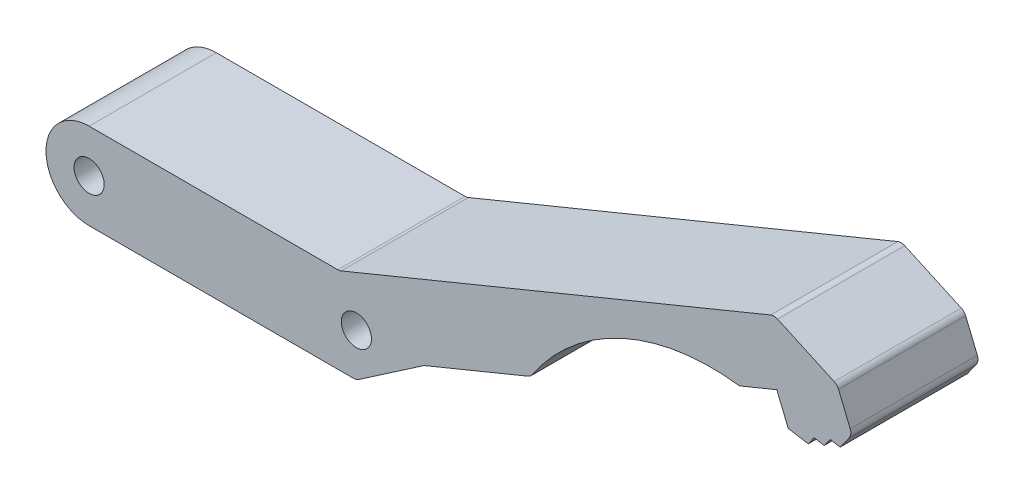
ISO-10303-21;
HEADER;
FILE_DESCRIPTION(('STEP AP214'),'2;1');
FILE_NAME('part.step','',(''),(''),'','','');
FILE_SCHEMA(('AUTOMOTIVE_DESIGN { 1 0 10303 214 1 1 1 1 }'));
ENDSEC;
DATA;
#1=APPLICATION_CONTEXT('core data for automotive mechanical design processes');
#2=APPLICATION_PROTOCOL_DEFINITION('international standard','automotive_design',2000,#1);
#3=PRODUCT_CONTEXT('',#1,'mechanical');
#4=PRODUCT('Part','Part','',(#3));
#5=PRODUCT_RELATED_PRODUCT_CATEGORY('part','',(#4));
#6=PRODUCT_DEFINITION_FORMATION('','',#4);
#7=PRODUCT_DEFINITION_CONTEXT('part definition',#1,'design');
#8=PRODUCT_DEFINITION('design','',#6,#7);
#9=PRODUCT_DEFINITION_SHAPE('','',#8);
#10=(LENGTH_UNIT() NAMED_UNIT(*) SI_UNIT(.MILLI.,.METRE.));
#11=(NAMED_UNIT(*) PLANE_ANGLE_UNIT() SI_UNIT($,.RADIAN.));
#12=(NAMED_UNIT(*) SI_UNIT($,.STERADIAN.) SOLID_ANGLE_UNIT());
#13=UNCERTAINTY_MEASURE_WITH_UNIT(LENGTH_MEASURE(1.E-05),#10,'distance_accuracy_value','');
#14=(GEOMETRIC_REPRESENTATION_CONTEXT(3) GLOBAL_UNCERTAINTY_ASSIGNED_CONTEXT((#13)) GLOBAL_UNIT_ASSIGNED_CONTEXT((#10,
#11,#12)) REPRESENTATION_CONTEXT('',''));
#15=CARTESIAN_POINT('',(0.,0.,0.));
#16=DIRECTION('',(0.,0.,1.));
#17=DIRECTION('',(1.,0.,0.));
#18=AXIS2_PLACEMENT_3D('',#15,#16,#17);
#19=CARTESIAN_POINT('',(4.18285581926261,-10.1735590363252,7.375));
#20=DIRECTION('',(0.380263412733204,-0.92487822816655,0.));
#21=DIRECTION('',(0.92487822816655,0.380263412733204,0.));
#22=AXIS2_PLACEMENT_3D('',#19,#20,#21);
#23=PLANE('',#22);
#24=DIRECTION('',(-0.92487822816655,-0.380263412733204,0.));
#25=VECTOR('',#24,1.);
#26=CARTESIAN_POINT('',(4.18285581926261,-10.1735590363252,-7.375));
#27=LINE('',#26,#25);
#28=CARTESIAN_POINT('',(41.9373455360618,5.34918835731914,-7.375));
#29=VERTEX_POINT('',#28);
#30=CARTESIAN_POINT('',(29.9516692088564,0.421281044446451,-7.375));
#31=VERTEX_POINT('',#30);
#32=EDGE_CURVE('E278',#29,#31,#27,.T.);
#33=ORIENTED_EDGE('',*,*,#32,.F.);
#34=DIRECTION('',(0.,0.,1.));
#35=VECTOR('',#34,1.);
#36=CARTESIAN_POINT('',(41.9373455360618,5.34918835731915,7.375));
#37=LINE('',#36,#35);
#38=CARTESIAN_POINT('',(41.9373455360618,5.34918835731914,7.375));
#39=VERTEX_POINT('',#38);
#40=EDGE_CURVE('E363',#29,#39,#37,.T.);
#41=ORIENTED_EDGE('',*,*,#40,.T.);
#42=DIRECTION('',(-0.92487822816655,-0.380263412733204,0.));
#43=VECTOR('',#42,1.);
#44=CARTESIAN_POINT('',(4.18285581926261,-10.1735590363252,7.375));
#45=LINE('',#44,#43);
#46=CARTESIAN_POINT('',(29.9516692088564,0.421281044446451,7.375));
#47=VERTEX_POINT('',#46);
#48=EDGE_CURVE('E215',#39,#47,#45,.T.);
#49=ORIENTED_EDGE('',*,*,#48,.T.);
#50=DIRECTION('',(0.,0.,-1.));
#51=VECTOR('',#50,1.);
#52=CARTESIAN_POINT('',(29.9516692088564,0.421281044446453,-7.375));
#53=LINE('',#52,#51);
#54=EDGE_CURVE('E360',#47,#31,#53,.T.);
#55=ORIENTED_EDGE('',*,*,#54,.T.);
#56=EDGE_LOOP('',(#33,#41,#49,#55));
#57=FACE_BOUND('',#56,.T.);
#58=ADVANCED_FACE('F41',(#57),#23,.T.);
#59=CARTESIAN_POINT('',(63.1527344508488,-8.10069108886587,7.375));
#60=DIRECTION('',(0.,0.,-1.));
#61=DIRECTION('',(-1.,0.,0.));
#62=AXIS2_PLACEMENT_3D('',#59,#60,#61);
#63=CYLINDRICAL_SURFACE('',#62,24.9423564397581);
#64=CARTESIAN_POINT('',(63.1527344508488,-8.10069108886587,7.375));
#65=DIRECTION('',(0.,0.,1.));
#66=DIRECTION('',(1.,0.,0.));
#67=AXIS2_PLACEMENT_3D('',#64,#65,#66);
#68=CIRCLE('',#67,24.9423564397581);
#69=CARTESIAN_POINT('',(42.3895297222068,5.71996280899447,7.375));
#70=VERTEX_POINT('',#69);
#71=CARTESIAN_POINT('',(66.4298223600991,16.6254456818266,7.375));
#72=VERTEX_POINT('',#71);
#73=EDGE_CURVE('E202',#70,#72,#68,.F.);
#74=ORIENTED_EDGE('',*,*,#73,.F.);
#75=DIRECTION('',(0.,0.,-1.));
#76=VECTOR('',#75,1.);
#77=CARTESIAN_POINT('',(42.3895297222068,5.71996280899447,7.375));
#78=LINE('',#77,#76);
#79=CARTESIAN_POINT('',(42.3895297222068,5.71996280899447,-7.375));
#80=VERTEX_POINT('',#79);
#81=EDGE_CURVE('E225',#70,#80,#78,.T.);
#82=ORIENTED_EDGE('',*,*,#81,.T.);
#83=CARTESIAN_POINT('',(63.1527344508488,-8.10069108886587,-7.375));
#84=DIRECTION('',(0.,0.,1.));
#85=DIRECTION('',(1.,0.,0.));
#86=AXIS2_PLACEMENT_3D('',#83,#84,#85);
#87=CIRCLE('',#86,24.9423564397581);
#88=CARTESIAN_POINT('',(66.4298223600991,16.6254456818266,-7.375));
#89=VERTEX_POINT('',#88);
#90=EDGE_CURVE('E221',#80,#89,#87,.F.);
#91=ORIENTED_EDGE('',*,*,#90,.T.);
#92=DIRECTION('',(0.,0.,-1.));
#93=VECTOR('',#92,1.);
#94=CARTESIAN_POINT('',(66.4298223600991,16.6254456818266,7.375));
#95=LINE('',#94,#93);
#96=EDGE_CURVE('E218',#72,#89,#95,.T.);
#97=ORIENTED_EDGE('',*,*,#96,.F.);
#98=EDGE_LOOP('',(#74,#82,#91,#97));
#99=FACE_BOUND('',#98,.T.);
#100=ADVANCED_FACE('F219',(#99),#63,.F.);
#101=CARTESIAN_POINT('',(3.75864457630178,-9.14179071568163,7.375));
#102=DIRECTION('',(0.380263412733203,-0.924878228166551,0.));
#103=DIRECTION('',(0.924878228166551,0.380263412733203,0.));
#104=AXIS2_PLACEMENT_3D('',#101,#102,#103);
#105=PLANE('',#104);
#106=DIRECTION('',(-0.924878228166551,-0.380263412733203,0.));
#107=VECTOR('',#106,1.);
#108=CARTESIAN_POINT('',(3.75864457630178,-9.14179071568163,-7.375));
#109=LINE('',#108,#107);
#110=CARTESIAN_POINT('',(70.7615639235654,18.4064399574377,-7.375));
#111=VERTEX_POINT('',#110);
#112=EDGE_CURVE('E282',#111,#89,#109,.T.);
#113=ORIENTED_EDGE('',*,*,#112,.F.);
#114=DIRECTION('',(0.,0.,-1.));
#115=VECTOR('',#114,1.);
#116=CARTESIAN_POINT('',(70.7615639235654,18.4064399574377,7.375));
#117=LINE('',#116,#115);
#118=CARTESIAN_POINT('',(70.7615639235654,18.4064399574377,7.375));
#119=VERTEX_POINT('',#118);
#120=EDGE_CURVE('E226',#119,#111,#117,.T.);
#121=ORIENTED_EDGE('',*,*,#120,.F.);
#122=DIRECTION('',(-0.924878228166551,-0.380263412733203,0.));
#123=VECTOR('',#122,1.);
#124=CARTESIAN_POINT('',(3.75864457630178,-9.14179071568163,7.375));
#125=LINE('',#124,#123);
#126=EDGE_CURVE('E208',#119,#72,#125,.T.);
#127=ORIENTED_EDGE('',*,*,#126,.T.);
#128=ORIENTED_EDGE('',*,*,#96,.T.);
#129=EDGE_LOOP('',(#113,#121,#127,#128));
#130=FACE_BOUND('',#129,.T.);
#131=ADVANCED_FACE('F228',(#130),#105,.T.);
#132=CARTESIAN_POINT('',(67.0029193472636,27.5482306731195,7.375));
#133=DIRECTION('',(-0.92487822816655,-0.380263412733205,0.));
#134=DIRECTION('',(0.380263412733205,-0.92487822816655,0.));
#135=AXIS2_PLACEMENT_3D('',#132,#133,#134);
#136=PLANE('',#135);
#137=DIRECTION('',(-0.380263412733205,0.92487822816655,0.));
#138=VECTOR('',#137,1.);
#139=CARTESIAN_POINT('',(67.0029193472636,27.5482306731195,-7.375));
#140=LINE('',#139,#138);
#141=CARTESIAN_POINT('',(72.0850784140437,15.1873825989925,-7.375));
#142=VERTEX_POINT('',#141);
#143=EDGE_CURVE('E284',#142,#111,#140,.T.);
#144=ORIENTED_EDGE('',*,*,#143,.F.);
#145=DIRECTION('',(0.,0.,-1.));
#146=VECTOR('',#145,1.);
#147=CARTESIAN_POINT('',(72.0850784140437,15.1873825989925,7.375));
#148=LINE('',#147,#146);
#149=CARTESIAN_POINT('',(72.0850784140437,15.1873825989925,7.375));
#150=VERTEX_POINT('',#149);
#151=EDGE_CURVE('E346',#150,#142,#148,.T.);
#152=ORIENTED_EDGE('',*,*,#151,.F.);
#153=DIRECTION('',(-0.380263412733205,0.92487822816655,0.));
#154=VECTOR('',#153,1.);
#155=CARTESIAN_POINT('',(67.0029193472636,27.5482306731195,7.375));
#156=LINE('',#155,#154);
#157=EDGE_CURVE('E229',#150,#119,#156,.T.);
#158=ORIENTED_EDGE('',*,*,#157,.T.);
#159=ORIENTED_EDGE('',*,*,#120,.T.);
#160=EDGE_LOOP('',(#144,#152,#158,#159));
#161=FACE_BOUND('',#160,.T.);
#162=ADVANCED_FACE('F532',(#161),#136,.T.);
#163=CARTESIAN_POINT('',(4.53896645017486,26.6791224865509,7.375));
#164=DIRECTION('',(0.167721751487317,0.98583437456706,0.));
#165=DIRECTION('',(-0.98583437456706,0.167721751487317,0.));
#166=AXIS2_PLACEMENT_3D('',#163,#164,#165);
#167=PLANE('',#166);
#168=DIRECTION('',(0.98583437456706,-0.167721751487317,0.));
#169=VECTOR('',#168,1.);
#170=CARTESIAN_POINT('',(4.53896645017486,26.6791224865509,-7.375));
#171=LINE('',#170,#169);
#172=CARTESIAN_POINT('',(74.4101641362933,14.7918116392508,-7.375));
#173=VERTEX_POINT('',#172);
#174=EDGE_CURVE('E287',#142,#173,#171,.T.);
#175=ORIENTED_EDGE('',*,*,#174,.T.);
#176=DIRECTION('',(0.,0.,-1.));
#177=VECTOR('',#176,1.);
#178=CARTESIAN_POINT('',(74.4101641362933,14.7918116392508,7.375));
#179=LINE('',#178,#177);
#180=CARTESIAN_POINT('',(74.4101641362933,14.7918116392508,7.375));
#181=VERTEX_POINT('',#180);
#182=EDGE_CURVE('E343',#181,#173,#179,.T.);
#183=ORIENTED_EDGE('',*,*,#182,.F.);
#184=DIRECTION('',(0.98583437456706,-0.167721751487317,0.));
#185=VECTOR('',#184,1.);
#186=CARTESIAN_POINT('',(4.53896645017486,26.6791224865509,7.375));
#187=LINE('',#186,#185);
#188=EDGE_CURVE('E231',#150,#181,#187,.T.);
#189=ORIENTED_EDGE('',*,*,#188,.F.);
#190=ORIENTED_EDGE('',*,*,#151,.T.);
#191=EDGE_LOOP('',(#175,#183,#189,#190));
#192=FACE_BOUND('',#191,.T.);
#193=ADVANCED_FACE('F534',(#192),#167,.F.);
#194=CARTESIAN_POINT('',(42.1351042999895,-30.2154280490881,7.375));
#195=DIRECTION('',(-0.812647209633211,0.582755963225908,0.));
#196=DIRECTION('',(-0.582755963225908,-0.812647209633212,0.));
#197=AXIS2_PLACEMENT_3D('',#194,#195,#196);
#198=PLANE('',#197);
#199=DIRECTION('',(0.582755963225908,0.812647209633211,0.));
#200=VECTOR('',#199,1.);
#201=CARTESIAN_POINT('',(42.1351042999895,-30.2154280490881,-7.375));
#202=LINE('',#201,#200);
#203=CARTESIAN_POINT('',(75.0973777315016,15.750123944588,-7.375));
#204=VERTEX_POINT('',#203);
#205=EDGE_CURVE('E290',#173,#204,#202,.T.);
#206=ORIENTED_EDGE('',*,*,#205,.T.);
#207=DIRECTION('',(0.,0.,-1.));
#208=VECTOR('',#207,1.);
#209=CARTESIAN_POINT('',(75.0973777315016,15.750123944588,7.375));
#210=LINE('',#209,#208);
#211=CARTESIAN_POINT('',(75.0973777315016,15.750123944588,7.375));
#212=VERTEX_POINT('',#211);
#213=EDGE_CURVE('E340',#212,#204,#210,.T.);
#214=ORIENTED_EDGE('',*,*,#213,.F.);
#215=DIRECTION('',(0.582755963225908,0.812647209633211,0.));
#216=VECTOR('',#215,1.);
#217=CARTESIAN_POINT('',(42.1351042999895,-30.2154280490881,7.375));
#218=LINE('',#217,#216);
#219=EDGE_CURVE('E237',#181,#212,#218,.T.);
#220=ORIENTED_EDGE('',*,*,#219,.F.);
#221=ORIENTED_EDGE('',*,*,#182,.T.);
#222=EDGE_LOOP('',(#206,#214,#220,#221));
#223=FACE_BOUND('',#222,.T.);
#224=ADVANCED_FACE('F526',(#223),#198,.F.);
#225=CARTESIAN_POINT('',(4.71675115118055,27.7241048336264,7.375));
#226=DIRECTION('',(0.167721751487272,0.985834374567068,0.));
#227=DIRECTION('',(-0.985834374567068,0.167721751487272,0.));
#228=AXIS2_PLACEMENT_3D('',#225,#226,#227);
#229=PLANE('',#228);
#230=DIRECTION('',(0.985834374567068,-0.167721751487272,0.));
#231=VECTOR('',#230,1.);
#232=CARTESIAN_POINT('',(4.71675115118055,27.7241048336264,-7.375));
#233=LINE('',#232,#231);
#234=CARTESIAN_POINT('',(76.2599205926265,15.5523384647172,-7.375));
#235=VERTEX_POINT('',#234);
#236=EDGE_CURVE('E293',#204,#235,#233,.T.);
#237=ORIENTED_EDGE('',*,*,#236,.T.);
#238=DIRECTION('',(0.,0.,-1.));
#239=VECTOR('',#238,1.);
#240=CARTESIAN_POINT('',(76.2599205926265,15.5523384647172,7.375));
#241=LINE('',#240,#239);
#242=CARTESIAN_POINT('',(76.2599205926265,15.5523384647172,7.375));
#243=VERTEX_POINT('',#242);
#244=EDGE_CURVE('E337',#243,#235,#241,.T.);
#245=ORIENTED_EDGE('',*,*,#244,.F.);
#246=DIRECTION('',(0.985834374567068,-0.167721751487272,0.));
#247=VECTOR('',#246,1.);
#248=CARTESIAN_POINT('',(4.71675115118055,27.7241048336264,7.375));
#249=LINE('',#248,#247);
#250=EDGE_CURVE('E240',#212,#243,#249,.T.);
#251=ORIENTED_EDGE('',*,*,#250,.F.);
#252=ORIENTED_EDGE('',*,*,#213,.T.);
#253=EDGE_LOOP('',(#237,#245,#251,#252));
#254=FACE_BOUND('',#253,.T.);
#255=ADVANCED_FACE('F523',(#254),#229,.F.);
#256=CARTESIAN_POINT('',(42.9965086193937,-30.8331481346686,7.375));
#257=DIRECTION('',(-0.812647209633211,0.582755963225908,0.));
#258=DIRECTION('',(-0.582755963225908,-0.812647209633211,0.));
#259=AXIS2_PLACEMENT_3D('',#256,#257,#258);
#260=PLANE('',#259);
#261=DIRECTION('',(0.582755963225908,0.812647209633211,0.));
#262=VECTOR('',#261,1.);
#263=CARTESIAN_POINT('',(42.9965086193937,-30.8331481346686,-7.375));
#264=LINE('',#263,#262);
#265=CARTESIAN_POINT('',(76.9471341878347,16.5106507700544,-7.375));
#266=VERTEX_POINT('',#265);
#267=EDGE_CURVE('E296',#235,#266,#264,.T.);
#268=ORIENTED_EDGE('',*,*,#267,.T.);
#269=DIRECTION('',(0.,0.,-1.));
#270=VECTOR('',#269,1.);
#271=CARTESIAN_POINT('',(76.9471341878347,16.5106507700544,7.375));
#272=LINE('',#271,#270);
#273=CARTESIAN_POINT('',(76.9471341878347,16.5106507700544,7.375));
#274=VERTEX_POINT('',#273);
#275=EDGE_CURVE('E334',#274,#266,#272,.T.);
#276=ORIENTED_EDGE('',*,*,#275,.F.);
#277=DIRECTION('',(0.582755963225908,0.812647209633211,0.));
#278=VECTOR('',#277,1.);
#279=CARTESIAN_POINT('',(42.9965086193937,-30.8331481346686,7.375));
#280=LINE('',#279,#278);
#281=EDGE_CURVE('E243',#243,#274,#280,.T.);
#282=ORIENTED_EDGE('',*,*,#281,.F.);
#283=ORIENTED_EDGE('',*,*,#244,.T.);
#284=EDGE_LOOP('',(#268,#276,#282,#283));
#285=FACE_BOUND('',#284,.T.);
#286=ADVANCED_FACE('F521',(#285),#260,.F.);
#287=CARTESIAN_POINT('',(4.89453585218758,28.7690871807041,7.375));
#288=DIRECTION('',(0.167721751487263,0.985834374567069,0.));
#289=DIRECTION('',(-0.985834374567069,0.167721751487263,0.));
#290=AXIS2_PLACEMENT_3D('',#287,#288,#289);
#291=PLANE('',#290);
#292=DIRECTION('',(0.985834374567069,-0.167721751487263,0.));
#293=VECTOR('',#292,1.);
#294=CARTESIAN_POINT('',(4.89453585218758,28.7690871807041,-7.375));
#295=LINE('',#294,#293);
#296=CARTESIAN_POINT('',(78.1096770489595,16.3128652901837,-7.375));
#297=VERTEX_POINT('',#296);
#298=EDGE_CURVE('E299',#266,#297,#295,.T.);
#299=ORIENTED_EDGE('',*,*,#298,.T.);
#300=DIRECTION('',(0.,0.,-1.));
#301=VECTOR('',#300,1.);
#302=CARTESIAN_POINT('',(78.1096770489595,16.3128652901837,7.375));
#303=LINE('',#302,#301);
#304=CARTESIAN_POINT('',(78.1096770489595,16.3128652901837,7.375));
#305=VERTEX_POINT('',#304);
#306=EDGE_CURVE('E331',#305,#297,#303,.T.);
#307=ORIENTED_EDGE('',*,*,#306,.F.);
#308=DIRECTION('',(0.985834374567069,-0.167721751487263,0.));
#309=VECTOR('',#308,1.);
#310=CARTESIAN_POINT('',(4.89453585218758,28.7690871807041,7.375));
#311=LINE('',#310,#309);
#312=EDGE_CURVE('E246',#274,#305,#311,.T.);
#313=ORIENTED_EDGE('',*,*,#312,.F.);
#314=ORIENTED_EDGE('',*,*,#275,.T.);
#315=EDGE_LOOP('',(#299,#307,#313,#314));
#316=FACE_BOUND('',#315,.T.);
#317=ADVANCED_FACE('F517',(#316),#291,.F.);
#318=CARTESIAN_POINT('',(43.8579129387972,-31.4508682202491,7.375));
#319=DIRECTION('',(-0.812647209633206,0.582755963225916,0.));
#320=DIRECTION('',(-0.582755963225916,-0.812647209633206,0.));
#321=AXIS2_PLACEMENT_3D('',#318,#319,#320);
#322=PLANE('',#321);
#323=DIRECTION('',(0.582755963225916,0.812647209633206,0.));
#324=VECTOR('',#323,1.);
#325=CARTESIAN_POINT('',(43.8579129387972,-31.4508682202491,-7.375));
#326=LINE('',#325,#324);
#327=CARTESIAN_POINT('',(79.161113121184,17.7790821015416,-7.375));
#328=VERTEX_POINT('',#327);
#329=EDGE_CURVE('E302',#297,#328,#326,.T.);
#330=ORIENTED_EDGE('',*,*,#329,.T.);
#331=DIRECTION('',(0.,0.,-1.));
#332=VECTOR('',#331,1.);
#333=CARTESIAN_POINT('',(79.161113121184,17.7790821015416,7.375));
#334=LINE('',#333,#332);
#335=CARTESIAN_POINT('',(79.161113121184,17.7790821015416,7.375));
#336=VERTEX_POINT('',#335);
#337=EDGE_CURVE('E386',#328,#336,#334,.F.);
#338=ORIENTED_EDGE('',*,*,#337,.T.);
#339=DIRECTION('',(0.582755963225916,0.812647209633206,0.));
#340=VECTOR('',#339,1.);
#341=CARTESIAN_POINT('',(43.8579129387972,-31.4508682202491,7.375));
#342=LINE('',#341,#340);
#343=EDGE_CURVE('E249',#305,#336,#342,.T.);
#344=ORIENTED_EDGE('',*,*,#343,.F.);
#345=ORIENTED_EDGE('',*,*,#306,.T.);
#346=EDGE_LOOP('',(#330,#338,#344,#345));
#347=FACE_BOUND('',#346,.T.);
#348=ADVANCED_FACE('F514',(#347),#322,.F.);
#349=CARTESIAN_POINT('',(74.4019451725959,30.5903379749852,7.375));
#350=DIRECTION('',(0.924878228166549,0.380263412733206,0.));
#351=DIRECTION('',(-0.380263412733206,0.924878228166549,0.));
#352=AXIS2_PLACEMENT_3D('',#349,#350,#351);
#353=PLANE('',#352);
#354=DIRECTION('',(0.380263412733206,-0.924878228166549,0.));
#355=VECTOR('',#354,1.);
#356=CARTESIAN_POINT('',(74.4019451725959,30.5903379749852,7.375));
#357=LINE('',#356,#355);
#358=CARTESIAN_POINT('',(77.9233252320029,22.0256229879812,7.375));
#359=VERTEX_POINT('',#358);
#360=CARTESIAN_POINT('',(79.2733441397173,18.7421014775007,7.375));
#361=VERTEX_POINT('',#360);
#362=EDGE_CURVE('E252',#359,#361,#357,.T.);
#363=ORIENTED_EDGE('',*,*,#362,.T.);
#364=DIRECTION('',(0.,0.,-1.));
#365=VECTOR('',#364,1.);
#366=CARTESIAN_POINT('',(79.2733441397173,18.7421014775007,-7.375));
#367=LINE('',#366,#365);
#368=CARTESIAN_POINT('',(79.2733441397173,18.7421014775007,-7.375));
#369=VERTEX_POINT('',#368);
#370=EDGE_CURVE('E383',#361,#369,#367,.T.);
#371=ORIENTED_EDGE('',*,*,#370,.T.);
#372=DIRECTION('',(0.380263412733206,-0.924878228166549,0.));
#373=VECTOR('',#372,1.);
#374=CARTESIAN_POINT('',(74.4019451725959,30.5903379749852,-7.375));
#375=LINE('',#374,#373);
#376=CARTESIAN_POINT('',(77.9233252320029,22.0256229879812,-7.375));
#377=VERTEX_POINT('',#376);
#378=EDGE_CURVE('E305',#377,#369,#375,.T.);
#379=ORIENTED_EDGE('',*,*,#378,.F.);
#380=DIRECTION('',(0.,0.,-1.));
#381=VECTOR('',#380,1.);
#382=CARTESIAN_POINT('',(77.9233252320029,22.0256229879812,7.375));
#383=LINE('',#382,#381);
#384=EDGE_CURVE('E381',#377,#359,#383,.F.);
#385=ORIENTED_EDGE('',*,*,#384,.T.);
#386=EDGE_LOOP('',(#363,#371,#379,#385));
#387=FACE_BOUND('',#386,.T.);
#388=ADVANCED_FACE('F508',(#387),#353,.T.);
#389=CARTESIAN_POINT('',(21.8103769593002,47.8823439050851,7.375));
#390=DIRECTION('',(0.414522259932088,0.910039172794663,0.));
#391=DIRECTION('',(-0.910039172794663,0.414522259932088,0.));
#392=AXIS2_PLACEMENT_3D('',#389,#390,#391);
#393=PLANE('',#392);
#394=DIRECTION('',(0.910039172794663,-0.414522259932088,0.));
#395=VECTOR('',#394,1.);
#396=CARTESIAN_POINT('',(21.8103769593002,47.8823439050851,7.375));
#397=LINE('',#396,#395);
#398=CARTESIAN_POINT('',(70.8500425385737,25.54480766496,7.375));
#399=VERTEX_POINT('',#398);
#400=CARTESIAN_POINT('',(77.4129692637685,22.5553987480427,7.375));
#401=VERTEX_POINT('',#400);
#402=EDGE_CURVE('E255',#399,#401,#397,.T.);
#403=ORIENTED_EDGE('',*,*,#402,.T.);
#404=DIRECTION('',(0.,0.,-1.));
#405=VECTOR('',#404,1.);
#406=CARTESIAN_POINT('',(77.4129692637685,22.5553987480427,7.375));
#407=LINE('',#406,#405);
#408=CARTESIAN_POINT('',(77.4129692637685,22.5553987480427,-7.375));
#409=VERTEX_POINT('',#408);
#410=EDGE_CURVE('E390',#401,#409,#407,.T.);
#411=ORIENTED_EDGE('',*,*,#410,.T.);
#412=DIRECTION('',(0.910039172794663,-0.414522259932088,0.));
#413=VECTOR('',#412,1.);
#414=CARTESIAN_POINT('',(21.8103769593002,47.8823439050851,-7.375));
#415=LINE('',#414,#413);
#416=CARTESIAN_POINT('',(70.8500425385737,25.54480766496,-7.375));
#417=VERTEX_POINT('',#416);
#418=EDGE_CURVE('E308',#417,#409,#415,.T.);
#419=ORIENTED_EDGE('',*,*,#418,.F.);
#420=DIRECTION('',(0.,0.,-1.));
#421=VECTOR('',#420,1.);
#422=CARTESIAN_POINT('',(70.8500425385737,25.54480766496,7.375));
#423=LINE('',#422,#421);
#424=EDGE_CURVE('E388',#417,#399,#423,.F.);
#425=ORIENTED_EDGE('',*,*,#424,.T.);
#426=EDGE_LOOP('',(#403,#411,#419,#425));
#427=FACE_BOUND('',#426,.T.);
#428=ADVANCED_FACE('F501',(#427),#393,.T.);
#429=CARTESIAN_POINT('',(1.14074851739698,-2.7745332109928,7.375));
#430=DIRECTION('',(-0.380263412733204,0.92487822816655,0.));
#431=DIRECTION('',(-0.92487822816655,-0.380263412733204,0.));
#432=AXIS2_PLACEMENT_3D('',#429,#430,#431);
#433=PLANE('',#432);
#434=DIRECTION('',(0.92487822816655,0.380263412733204,0.));
#435=VECTOR('',#434,1.);
#436=CARTESIAN_POINT('',(1.14074851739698,-2.7745332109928,-7.375));
#437=LINE('',#436,#435);
#438=CARTESIAN_POINT('',(20.2327114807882,5.07512177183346,-7.375));
#439=VERTEX_POINT('',#438);
#440=CARTESIAN_POINT('',(70.0552568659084,25.5596467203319,-7.375));
#441=VERTEX_POINT('',#440);
#442=EDGE_CURVE('E311',#439,#441,#437,.T.);
#443=ORIENTED_EDGE('',*,*,#442,.F.);
#444=DIRECTION('',(0.,0.,-1.));
#445=VECTOR('',#444,1.);
#446=CARTESIAN_POINT('',(20.2327114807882,5.07512177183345,7.375));
#447=LINE('',#446,#445);
#448=CARTESIAN_POINT('',(20.2327114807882,5.07512177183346,7.375));
#449=VERTEX_POINT('',#448);
#450=EDGE_CURVE('E379',#439,#449,#447,.F.);
#451=ORIENTED_EDGE('',*,*,#450,.T.);
#452=DIRECTION('',(0.92487822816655,0.380263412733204,0.));
#453=VECTOR('',#452,1.);
#454=CARTESIAN_POINT('',(1.14074851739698,-2.7745332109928,7.375));
#455=LINE('',#454,#453);
#456=CARTESIAN_POINT('',(70.0552568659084,25.5596467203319,7.375));
#457=VERTEX_POINT('',#456);
#458=EDGE_CURVE('E258',#449,#457,#455,.T.);
#459=ORIENTED_EDGE('',*,*,#458,.T.);
#460=DIRECTION('',(0.,0.,-1.));
#461=VECTOR('',#460,1.);
#462=CARTESIAN_POINT('',(70.0552568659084,25.5596467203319,7.375));
#463=LINE('',#462,#461);
#464=EDGE_CURVE('E376',#457,#441,#463,.T.);
#465=ORIENTED_EDGE('',*,*,#464,.T.);
#466=EDGE_LOOP('',(#443,#451,#459,#465));
#467=FACE_BOUND('',#466,.T.);
#468=ADVANCED_FACE('F494',(#467),#433,.T.);
#469=CARTESIAN_POINT('',(0.,5.,7.375));
#470=DIRECTION('',(0.,1.,0.));
#471=DIRECTION('',(-1.,0.,0.));
#472=AXIS2_PLACEMENT_3D('',#469,#470,#471);
#473=PLANE('',#472);
#474=DIRECTION('',(1.,0.,0.));
#475=VECTOR('',#474,1.);
#476=CARTESIAN_POINT('',(0.,5.,7.375));
#477=LINE('',#476,#475);
#478=CARTESIAN_POINT('',(-9.,5.,7.375));
#479=VERTEX_POINT('',#478);
#480=CARTESIAN_POINT('',(19.852448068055,5.,7.375));
#481=VERTEX_POINT('',#480);
#482=EDGE_CURVE('E261',#479,#481,#477,.T.);
#483=ORIENTED_EDGE('',*,*,#482,.T.);
#484=DIRECTION('',(0.,0.,-1.));
#485=VECTOR('',#484,1.);
#486=CARTESIAN_POINT('',(19.852448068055,5.,-7.375));
#487=LINE('',#486,#485);
#488=CARTESIAN_POINT('',(19.852448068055,5.,-7.375));
#489=VERTEX_POINT('',#488);
#490=EDGE_CURVE('E373',#481,#489,#487,.T.);
#491=ORIENTED_EDGE('',*,*,#490,.T.);
#492=DIRECTION('',(1.,0.,0.));
#493=VECTOR('',#492,1.);
#494=CARTESIAN_POINT('',(0.,5.,-7.375));
#495=LINE('',#494,#493);
#496=CARTESIAN_POINT('',(-9.,5.,-7.375));
#497=VERTEX_POINT('',#496);
#498=EDGE_CURVE('E314',#497,#489,#495,.T.);
#499=ORIENTED_EDGE('',*,*,#498,.F.);
#500=DIRECTION('',(0.,0.,-1.));
#501=VECTOR('',#500,1.);
#502=CARTESIAN_POINT('',(-9.,5.,7.375));
#503=LINE('',#502,#501);
#504=EDGE_CURVE('E329',#479,#497,#503,.T.);
#505=ORIENTED_EDGE('',*,*,#504,.F.);
#506=EDGE_LOOP('',(#483,#491,#499,#505));
#507=FACE_BOUND('',#506,.T.);
#508=ADVANCED_FACE('F487',(#507),#473,.T.);
#509=CARTESIAN_POINT('',(-9.,0.,7.375));
#510=DIRECTION('',(0.,0.,-1.));
#511=DIRECTION('',(-1.,0.,0.));
#512=AXIS2_PLACEMENT_3D('',#509,#510,#511);
#513=CYLINDRICAL_SURFACE('',#512,5.);
#514=CARTESIAN_POINT('',(-9.,0.,-7.375));
#515=DIRECTION('',(0.,0.,1.));
#516=DIRECTION('',(1.,0.,0.));
#517=AXIS2_PLACEMENT_3D('',#514,#515,#516);
#518=CIRCLE('',#517,5.);
#519=CARTESIAN_POINT('',(-9.,-5.,-7.375));
#520=VERTEX_POINT('',#519);
#521=EDGE_CURVE('E317',#497,#520,#518,.T.);
#522=ORIENTED_EDGE('',*,*,#521,.T.);
#523=DIRECTION('',(0.,0.,-1.));
#524=VECTOR('',#523,1.);
#525=CARTESIAN_POINT('',(-9.,-5.,7.375));
#526=LINE('',#525,#524);
#527=CARTESIAN_POINT('',(-9.,-5.,7.375));
#528=VERTEX_POINT('',#527);
#529=EDGE_CURVE('E271',#528,#520,#526,.T.);
#530=ORIENTED_EDGE('',*,*,#529,.F.);
#531=CARTESIAN_POINT('',(-9.,0.,7.375));
#532=DIRECTION('',(0.,0.,1.));
#533=DIRECTION('',(1.,0.,0.));
#534=AXIS2_PLACEMENT_3D('',#531,#532,#533);
#535=CIRCLE('',#534,5.);
#536=EDGE_CURVE('E264',#479,#528,#535,.T.);
#537=ORIENTED_EDGE('',*,*,#536,.F.);
#538=ORIENTED_EDGE('',*,*,#504,.T.);
#539=EDGE_LOOP('',(#522,#530,#537,#538));
#540=FACE_BOUND('',#539,.T.);
#541=ADVANCED_FACE('F484',(#540),#513,.T.);
#542=CARTESIAN_POINT('',(0.,-5.,7.375));
#543=DIRECTION('',(0.,1.,0.));
#544=DIRECTION('',(-1.,0.,0.));
#545=AXIS2_PLACEMENT_3D('',#542,#543,#544);
#546=PLANE('',#545);
#547=DIRECTION('',(1.,0.,0.));
#548=VECTOR('',#547,1.);
#549=CARTESIAN_POINT('',(0.,-5.,-7.375));
#550=LINE('',#549,#548);
#551=CARTESIAN_POINT('',(21.6902867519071,-5.,-7.375));
#552=VERTEX_POINT('',#551);
#553=EDGE_CURVE('E320',#520,#552,#550,.T.);
#554=ORIENTED_EDGE('',*,*,#553,.T.);
#555=DIRECTION('',(0.,0.,-1.));
#556=VECTOR('',#555,1.);
#557=CARTESIAN_POINT('',(21.6902867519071,-5.,7.375));
#558=LINE('',#557,#556);
#559=CARTESIAN_POINT('',(21.6902867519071,-5.,7.375));
#560=VERTEX_POINT('',#559);
#561=EDGE_CURVE('E397',#552,#560,#558,.F.);
#562=ORIENTED_EDGE('',*,*,#561,.T.);
#563=DIRECTION('',(1.,0.,0.));
#564=VECTOR('',#563,1.);
#565=CARTESIAN_POINT('',(0.,-5.,7.375));
#566=LINE('',#565,#564);
#567=EDGE_CURVE('E267',#528,#560,#566,.T.);
#568=ORIENTED_EDGE('',*,*,#567,.F.);
#569=ORIENTED_EDGE('',*,*,#529,.T.);
#570=EDGE_LOOP('',(#554,#562,#568,#569));
#571=FACE_BOUND('',#570,.T.);
#572=ADVANCED_FACE('F432',(#571),#546,.F.);
#573=CARTESIAN_POINT('',(22.,0.,7.375));
#574=DIRECTION('',(0.,0.,-1.));
#575=DIRECTION('',(-1.,0.,0.));
#576=AXIS2_PLACEMENT_3D('',#573,#574,#575);
#577=CYLINDRICAL_SURFACE('',#576,1.75);
#578=CARTESIAN_POINT('',(22.,0.,7.375));
#579=DIRECTION('',(0.,0.,1.));
#580=DIRECTION('',(1.,0.,0.));
#581=AXIS2_PLACEMENT_3D('',#578,#579,#580);
#582=CIRCLE('',#581,1.75);
#583=CARTESIAN_POINT('',(23.75,0.,7.375));
#584=VERTEX_POINT('',#583);
#585=EDGE_CURVE('E414',#584,#584,#582,.T.);
#586=ORIENTED_EDGE('',*,*,#585,.T.);
#587=EDGE_LOOP('',(#586));
#588=FACE_BOUND('',#587,.T.);
#589=CARTESIAN_POINT('',(22.,0.,-7.375));
#590=DIRECTION('',(0.,0.,1.));
#591=DIRECTION('',(1.,0.,0.));
#592=AXIS2_PLACEMENT_3D('',#589,#590,#591);
#593=CIRCLE('',#592,1.75);
#594=CARTESIAN_POINT('',(23.75,0.,-7.375));
#595=VERTEX_POINT('',#594);
#596=EDGE_CURVE('E275',#595,#595,#593,.T.);
#597=ORIENTED_EDGE('',*,*,#596,.F.);
#598=EDGE_LOOP('',(#597));
#599=FACE_BOUND('',#598,.T.);
#600=ADVANCED_FACE('F429',(#588,#599),#577,.F.);
#601=CARTESIAN_POINT('',(-9.,0.,7.375));
#602=DIRECTION('',(0.,0.,-1.));
#603=DIRECTION('',(-1.,0.,0.));
#604=AXIS2_PLACEMENT_3D('',#601,#602,#603);
#605=CYLINDRICAL_SURFACE('',#604,1.75);
#606=CARTESIAN_POINT('',(-9.,0.,7.375));
#607=DIRECTION('',(0.,0.,1.));
#608=DIRECTION('',(1.,0.,0.));
#609=AXIS2_PLACEMENT_3D('',#606,#607,#608);
#610=CIRCLE('',#609,1.75);
#611=CARTESIAN_POINT('',(-7.25,0.,7.375));
#612=VERTEX_POINT('',#611);
#613=EDGE_CURVE('E326',#612,#612,#610,.T.);
#614=ORIENTED_EDGE('',*,*,#613,.T.);
#615=EDGE_LOOP('',(#614));
#616=FACE_BOUND('',#615,.T.);
#617=CARTESIAN_POINT('',(-9.,0.,-7.375));
#618=DIRECTION('',(0.,0.,1.));
#619=DIRECTION('',(1.,0.,0.));
#620=AXIS2_PLACEMENT_3D('',#617,#618,#619);
#621=CIRCLE('',#620,1.75);
#622=CARTESIAN_POINT('',(-7.25,0.,-7.375));
#623=VERTEX_POINT('',#622);
#624=EDGE_CURVE('E272',#623,#623,#621,.T.);
#625=ORIENTED_EDGE('',*,*,#624,.F.);
#626=EDGE_LOOP('',(#625));
#627=FACE_BOUND('',#626,.T.);
#628=ADVANCED_FACE('F421',(#616,#627),#605,.F.);
#629=CARTESIAN_POINT('',(9.35951951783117,-13.6605924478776,7.375));
#630=DIRECTION('',(0.565210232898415,-0.824946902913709,0.));
#631=DIRECTION('',(0.824946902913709,0.565210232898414,0.));
#632=AXIS2_PLACEMENT_3D('',#629,#630,#631);
#633=PLANE('',#632);
#634=DIRECTION('',(-0.824946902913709,-0.565210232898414,0.));
#635=VECTOR('',#634,1.);
#636=CARTESIAN_POINT('',(9.35951951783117,-13.6605924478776,-7.375));
#637=LINE('',#636,#635);
#638=CARTESIAN_POINT('',(29.7667223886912,0.321349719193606,-7.375));
#639=VERTEX_POINT('',#638);
#640=CARTESIAN_POINT('',(22.2554969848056,-4.82494690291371,-7.375));
#641=VERTEX_POINT('',#640);
#642=EDGE_CURVE('E323',#639,#641,#637,.T.);
#643=ORIENTED_EDGE('',*,*,#642,.F.);
#644=DIRECTION('',(0.,0.,-1.));
#645=VECTOR('',#644,1.);
#646=CARTESIAN_POINT('',(29.7667223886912,0.321349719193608,7.375));
#647=LINE('',#646,#645);
#648=CARTESIAN_POINT('',(29.7667223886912,0.321349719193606,7.375));
#649=VERTEX_POINT('',#648);
#650=EDGE_CURVE('E63',#639,#649,#647,.F.);
#651=ORIENTED_EDGE('',*,*,#650,.T.);
#652=DIRECTION('',(-0.824946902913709,-0.565210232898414,0.));
#653=VECTOR('',#652,1.);
#654=CARTESIAN_POINT('',(9.35951951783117,-13.6605924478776,7.375));
#655=LINE('',#654,#653);
#656=CARTESIAN_POINT('',(22.2554969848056,-4.82494690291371,7.375));
#657=VERTEX_POINT('',#656);
#658=EDGE_CURVE('E269',#649,#657,#655,.T.);
#659=ORIENTED_EDGE('',*,*,#658,.T.);
#660=DIRECTION('',(0.,0.,-1.));
#661=VECTOR('',#660,1.);
#662=CARTESIAN_POINT('',(22.2554969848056,-4.82494690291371,-7.375));
#663=LINE('',#662,#661);
#664=EDGE_CURVE('E393',#657,#641,#663,.T.);
#665=ORIENTED_EDGE('',*,*,#664,.T.);
#666=EDGE_LOOP('',(#643,#651,#659,#665));
#667=FACE_BOUND('',#666,.T.);
#668=ADVANCED_FACE('F407',(#667),#633,.T.);
#669=CARTESIAN_POINT('',(0.,0.,7.375));
#670=DIRECTION('',(0.,0.,1.));
#671=DIRECTION('',(1.,0.,0.));
#672=AXIS2_PLACEMENT_3D('',#669,#670,#671);
#673=PLANE('',#672);
#674=ORIENTED_EDGE('',*,*,#613,.F.);
#675=EDGE_LOOP('',(#674));
#676=FACE_BOUND('',#675,.T.);
#677=ORIENTED_EDGE('',*,*,#585,.F.);
#678=EDGE_LOOP('',(#677));
#679=FACE_BOUND('',#678,.T.);
#680=ORIENTED_EDGE('',*,*,#48,.F.);
#681=CARTESIAN_POINT('',(41.5570821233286,6.2740665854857,7.375));
#682=DIRECTION('',(0.,0.,1.));
#683=DIRECTION('',(1.,0.,0.));
#684=AXIS2_PLACEMENT_3D('',#681,#682,#683);
#685=CIRCLE('',#684,1.);
#686=EDGE_CURVE('E211',#39,#70,#685,.T.);
#687=ORIENTED_EDGE('',*,*,#686,.T.);
#688=ORIENTED_EDGE('',*,*,#73,.T.);
#689=ORIENTED_EDGE('',*,*,#126,.F.);
#690=ORIENTED_EDGE('',*,*,#157,.F.);
#691=ORIENTED_EDGE('',*,*,#188,.T.);
#692=ORIENTED_EDGE('',*,*,#219,.T.);
#693=ORIENTED_EDGE('',*,*,#250,.T.);
#694=ORIENTED_EDGE('',*,*,#281,.T.);
#695=ORIENTED_EDGE('',*,*,#312,.T.);
#696=ORIENTED_EDGE('',*,*,#343,.T.);
#697=CARTESIAN_POINT('',(78.3484659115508,18.3618380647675,7.375));
#698=DIRECTION('',(0.,0.,1.));
#699=DIRECTION('',(1.,0.,0.));
#700=AXIS2_PLACEMENT_3D('',#697,#698,#699);
#701=CIRCLE('',#700,1.);
#702=EDGE_CURVE('E370',#336,#361,#701,.T.);
#703=ORIENTED_EDGE('',*,*,#702,.T.);
#704=ORIENTED_EDGE('',*,*,#362,.F.);
#705=CARTESIAN_POINT('',(76.9984470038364,21.645359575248,7.375));
#706=DIRECTION('',(0.,0.,1.));
#707=DIRECTION('',(1.,0.,0.));
#708=AXIS2_PLACEMENT_3D('',#705,#706,#707);
#709=CIRCLE('',#708,1.);
#710=EDGE_CURVE('E368',#359,#401,#709,.T.);
#711=ORIENTED_EDGE('',*,*,#710,.T.);
#712=ORIENTED_EDGE('',*,*,#402,.F.);
#713=CARTESIAN_POINT('',(70.4355202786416,24.6347684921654,7.375));
#714=DIRECTION('',(0.,0.,1.));
#715=DIRECTION('',(1.,0.,0.));
#716=AXIS2_PLACEMENT_3D('',#713,#714,#715);
#717=CIRCLE('',#716,1.);
#718=EDGE_CURVE('E366',#399,#457,#717,.T.);
#719=ORIENTED_EDGE('',*,*,#718,.T.);
#720=ORIENTED_EDGE('',*,*,#458,.F.);
#721=CARTESIAN_POINT('',(19.852448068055,6.,7.375));
#722=DIRECTION('',(0.,0.,1.));
#723=DIRECTION('',(1.,0.,0.));
#724=AXIS2_PLACEMENT_3D('',#721,#722,#723);
#725=CIRCLE('',#724,1.);
#726=EDGE_CURVE('E401',#449,#481,#725,.F.);
#727=ORIENTED_EDGE('',*,*,#726,.T.);
#728=ORIENTED_EDGE('',*,*,#482,.F.);
#729=ORIENTED_EDGE('',*,*,#536,.T.);
#730=ORIENTED_EDGE('',*,*,#567,.T.);
#731=CARTESIAN_POINT('',(21.6902867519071,-4.,7.375));
#732=DIRECTION('',(0.,0.,1.));
#733=DIRECTION('',(1.,0.,0.));
#734=AXIS2_PLACEMENT_3D('',#731,#732,#733);
#735=CIRCLE('',#734,1.);
#736=EDGE_CURVE('E56',#560,#657,#735,.T.);
#737=ORIENTED_EDGE('',*,*,#736,.T.);
#738=ORIENTED_EDGE('',*,*,#658,.F.);
#739=CARTESIAN_POINT('',(30.3319326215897,-0.503597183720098,7.375));
#740=DIRECTION('',(0.,0.,1.));
#741=DIRECTION('',(1.,0.,0.));
#742=AXIS2_PLACEMENT_3D('',#739,#740,#741);
#743=CIRCLE('',#742,1.);
#744=EDGE_CURVE('E11',#649,#47,#743,.F.);
#745=ORIENTED_EDGE('',*,*,#744,.T.);
#746=EDGE_LOOP('',(#680,#687,#688,#689,#690,#691,#692,#693,#694,#695,#696,#703,#704,#711,#712,
#719,#720,#727,#728,#729,#730,#737,#738,#745));
#747=FACE_BOUND('',#746,.T.);
#748=ADVANCED_FACE('F205',(#676,#679,#747),#673,.T.);
#749=CARTESIAN_POINT('',(0.,0.,-7.375));
#750=DIRECTION('',(0.,0.,1.));
#751=DIRECTION('',(1.,0.,0.));
#752=AXIS2_PLACEMENT_3D('',#749,#750,#751);
#753=PLANE('',#752);
#754=ORIENTED_EDGE('',*,*,#624,.T.);
#755=EDGE_LOOP('',(#754));
#756=FACE_BOUND('',#755,.T.);
#757=ORIENTED_EDGE('',*,*,#596,.T.);
#758=EDGE_LOOP('',(#757));
#759=FACE_BOUND('',#758,.T.);
#760=ORIENTED_EDGE('',*,*,#90,.F.);
#761=CARTESIAN_POINT('',(41.5570821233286,6.2740665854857,-7.375));
#762=DIRECTION('',(0.,0.,1.));
#763=DIRECTION('',(1.,0.,0.));
#764=AXIS2_PLACEMENT_3D('',#761,#762,#763);
#765=CIRCLE('',#764,1.);
#766=EDGE_CURVE('E358',#80,#29,#765,.F.);
#767=ORIENTED_EDGE('',*,*,#766,.T.);
#768=ORIENTED_EDGE('',*,*,#32,.T.);
#769=CARTESIAN_POINT('',(30.3319326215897,-0.503597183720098,-7.375));
#770=DIRECTION('',(0.,0.,1.));
#771=DIRECTION('',(1.,0.,0.));
#772=AXIS2_PLACEMENT_3D('',#769,#770,#771);
#773=CIRCLE('',#772,1.);
#774=EDGE_CURVE('E49',#31,#639,#773,.T.);
#775=ORIENTED_EDGE('',*,*,#774,.T.);
#776=ORIENTED_EDGE('',*,*,#642,.T.);
#777=CARTESIAN_POINT('',(21.6902867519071,-4.,-7.375));
#778=DIRECTION('',(0.,0.,1.));
#779=DIRECTION('',(1.,0.,0.));
#780=AXIS2_PLACEMENT_3D('',#777,#778,#779);
#781=CIRCLE('',#780,1.);
#782=EDGE_CURVE('E350',#641,#552,#781,.F.);
#783=ORIENTED_EDGE('',*,*,#782,.T.);
#784=ORIENTED_EDGE('',*,*,#553,.F.);
#785=ORIENTED_EDGE('',*,*,#521,.F.);
#786=ORIENTED_EDGE('',*,*,#498,.T.);
#787=CARTESIAN_POINT('',(19.852448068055,6.,-7.375));
#788=DIRECTION('',(0.,0.,1.));
#789=DIRECTION('',(1.,0.,0.));
#790=AXIS2_PLACEMENT_3D('',#787,#788,#789);
#791=CIRCLE('',#790,1.);
#792=EDGE_CURVE('E399',#489,#439,#791,.T.);
#793=ORIENTED_EDGE('',*,*,#792,.T.);
#794=ORIENTED_EDGE('',*,*,#442,.T.);
#795=CARTESIAN_POINT('',(70.4355202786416,24.6347684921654,-7.375));
#796=DIRECTION('',(0.,0.,1.));
#797=DIRECTION('',(1.,0.,0.));
#798=AXIS2_PLACEMENT_3D('',#795,#796,#797);
#799=CIRCLE('',#798,1.);
#800=EDGE_CURVE('E352',#441,#417,#799,.F.);
#801=ORIENTED_EDGE('',*,*,#800,.T.);
#802=ORIENTED_EDGE('',*,*,#418,.T.);
#803=CARTESIAN_POINT('',(76.9984470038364,21.645359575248,-7.375));
#804=DIRECTION('',(0.,0.,1.));
#805=DIRECTION('',(1.,0.,0.));
#806=AXIS2_PLACEMENT_3D('',#803,#804,#805);
#807=CIRCLE('',#806,1.);
#808=EDGE_CURVE('E354',#409,#377,#807,.F.);
#809=ORIENTED_EDGE('',*,*,#808,.T.);
#810=ORIENTED_EDGE('',*,*,#378,.T.);
#811=CARTESIAN_POINT('',(78.3484659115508,18.3618380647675,-7.375));
#812=DIRECTION('',(0.,0.,1.));
#813=DIRECTION('',(1.,0.,0.));
#814=AXIS2_PLACEMENT_3D('',#811,#812,#813);
#815=CIRCLE('',#814,1.);
#816=EDGE_CURVE('E356',#369,#328,#815,.F.);
#817=ORIENTED_EDGE('',*,*,#816,.T.);
#818=ORIENTED_EDGE('',*,*,#329,.F.);
#819=ORIENTED_EDGE('',*,*,#298,.F.);
#820=ORIENTED_EDGE('',*,*,#267,.F.);
#821=ORIENTED_EDGE('',*,*,#236,.F.);
#822=ORIENTED_EDGE('',*,*,#205,.F.);
#823=ORIENTED_EDGE('',*,*,#174,.F.);
#824=ORIENTED_EDGE('',*,*,#143,.T.);
#825=ORIENTED_EDGE('',*,*,#112,.T.);
#826=EDGE_LOOP('',(#760,#767,#768,#775,#776,#783,#784,#785,#786,#793,#794,#801,#802,#809,#810,
#817,#818,#819,#820,#821,#822,#823,#824,#825));
#827=FACE_BOUND('',#826,.T.);
#828=ADVANCED_FACE('F403',(#756,#759,#827),#753,.F.);
#829=CARTESIAN_POINT('',(41.5570821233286,6.2740665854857,7.375));
#830=DIRECTION('',(0.,0.,-1.));
#831=DIRECTION('',(-1.,0.,0.));
#832=AXIS2_PLACEMENT_3D('',#829,#830,#831);
#833=CYLINDRICAL_SURFACE('',#832,1.);
#834=ORIENTED_EDGE('',*,*,#686,.F.);
#835=ORIENTED_EDGE('',*,*,#40,.F.);
#836=ORIENTED_EDGE('',*,*,#766,.F.);
#837=ORIENTED_EDGE('',*,*,#81,.F.);
#838=EDGE_LOOP('',(#834,#835,#836,#837));
#839=FACE_BOUND('',#838,.T.);
#840=ADVANCED_FACE('F437',(#839),#833,.T.);
#841=CARTESIAN_POINT('',(19.852448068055,6.,7.375));
#842=DIRECTION('',(0.,0.,1.));
#843=DIRECTION('',(1.,0.,0.));
#844=AXIS2_PLACEMENT_3D('',#841,#842,#843);
#845=CYLINDRICAL_SURFACE('',#844,1.);
#846=ORIENTED_EDGE('',*,*,#726,.F.);
#847=ORIENTED_EDGE('',*,*,#450,.F.);
#848=ORIENTED_EDGE('',*,*,#792,.F.);
#849=ORIENTED_EDGE('',*,*,#490,.F.);
#850=EDGE_LOOP('',(#846,#847,#848,#849));
#851=FACE_BOUND('',#850,.T.);
#852=ADVANCED_FACE('F443',(#851),#845,.F.);
#853=CARTESIAN_POINT('',(78.3484659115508,18.3618380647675,7.375));
#854=DIRECTION('',(0.,0.,1.));
#855=DIRECTION('',(1.,0.,0.));
#856=AXIS2_PLACEMENT_3D('',#853,#854,#855);
#857=CYLINDRICAL_SURFACE('',#856,1.);
#858=ORIENTED_EDGE('',*,*,#702,.F.);
#859=ORIENTED_EDGE('',*,*,#337,.F.);
#860=ORIENTED_EDGE('',*,*,#816,.F.);
#861=ORIENTED_EDGE('',*,*,#370,.F.);
#862=EDGE_LOOP('',(#858,#859,#860,#861));
#863=FACE_BOUND('',#862,.T.);
#864=ADVANCED_FACE('F459',(#863),#857,.T.);
#865=CARTESIAN_POINT('',(76.9984470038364,21.645359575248,7.375));
#866=DIRECTION('',(0.,0.,-1.));
#867=DIRECTION('',(-1.,0.,0.));
#868=AXIS2_PLACEMENT_3D('',#865,#866,#867);
#869=CYLINDRICAL_SURFACE('',#868,1.);
#870=ORIENTED_EDGE('',*,*,#710,.F.);
#871=ORIENTED_EDGE('',*,*,#384,.F.);
#872=ORIENTED_EDGE('',*,*,#808,.F.);
#873=ORIENTED_EDGE('',*,*,#410,.F.);
#874=EDGE_LOOP('',(#870,#871,#872,#873));
#875=FACE_BOUND('',#874,.T.);
#876=ADVANCED_FACE('F463',(#875),#869,.T.);
#877=CARTESIAN_POINT('',(70.4355202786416,24.6347684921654,7.375));
#878=DIRECTION('',(0.,0.,-1.));
#879=DIRECTION('',(-1.,0.,0.));
#880=AXIS2_PLACEMENT_3D('',#877,#878,#879);
#881=CYLINDRICAL_SURFACE('',#880,1.);
#882=ORIENTED_EDGE('',*,*,#718,.F.);
#883=ORIENTED_EDGE('',*,*,#424,.F.);
#884=ORIENTED_EDGE('',*,*,#800,.F.);
#885=ORIENTED_EDGE('',*,*,#464,.F.);
#886=EDGE_LOOP('',(#882,#883,#884,#885));
#887=FACE_BOUND('',#886,.T.);
#888=ADVANCED_FACE('F467',(#887),#881,.T.);
#889=CARTESIAN_POINT('',(30.3319326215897,-0.503597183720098,7.375));
#890=DIRECTION('',(0.,0.,1.));
#891=DIRECTION('',(1.,0.,0.));
#892=AXIS2_PLACEMENT_3D('',#889,#890,#891);
#893=CYLINDRICAL_SURFACE('',#892,1.);
#894=ORIENTED_EDGE('',*,*,#744,.F.);
#895=ORIENTED_EDGE('',*,*,#650,.F.);
#896=ORIENTED_EDGE('',*,*,#774,.F.);
#897=ORIENTED_EDGE('',*,*,#54,.F.);
#898=EDGE_LOOP('',(#894,#895,#896,#897));
#899=FACE_BOUND('',#898,.T.);
#900=ADVANCED_FACE('F410',(#899),#893,.F.);
#901=CARTESIAN_POINT('',(21.6902867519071,-4.,7.375));
#902=DIRECTION('',(0.,0.,1.));
#903=DIRECTION('',(1.,0.,0.));
#904=AXIS2_PLACEMENT_3D('',#901,#902,#903);
#905=CYLINDRICAL_SURFACE('',#904,1.);
#906=ORIENTED_EDGE('',*,*,#736,.F.);
#907=ORIENTED_EDGE('',*,*,#561,.F.);
#908=ORIENTED_EDGE('',*,*,#782,.F.);
#909=ORIENTED_EDGE('',*,*,#664,.F.);
#910=EDGE_LOOP('',(#906,#907,#908,#909));
#911=FACE_BOUND('',#910,.T.);
#912=ADVANCED_FACE('F43',(#911),#905,.T.);
#913=CLOSED_SHELL('',(#58,#100,#131,#162,#193,#224,#255,#286,#317,#348,#388,#428,#468,#508,#541,
#572,#600,#628,#668,#748,#828,#840,#852,#864,#876,#888,#900,#912));
#914=MANIFOLD_SOLID_BREP('B2',#913);
#915=ADVANCED_BREP_SHAPE_REPRESENTATION('',(#18,#914),#14);
#916=SHAPE_DEFINITION_REPRESENTATION(#9,#915);
ENDSEC;
END-ISO-10303-21;
